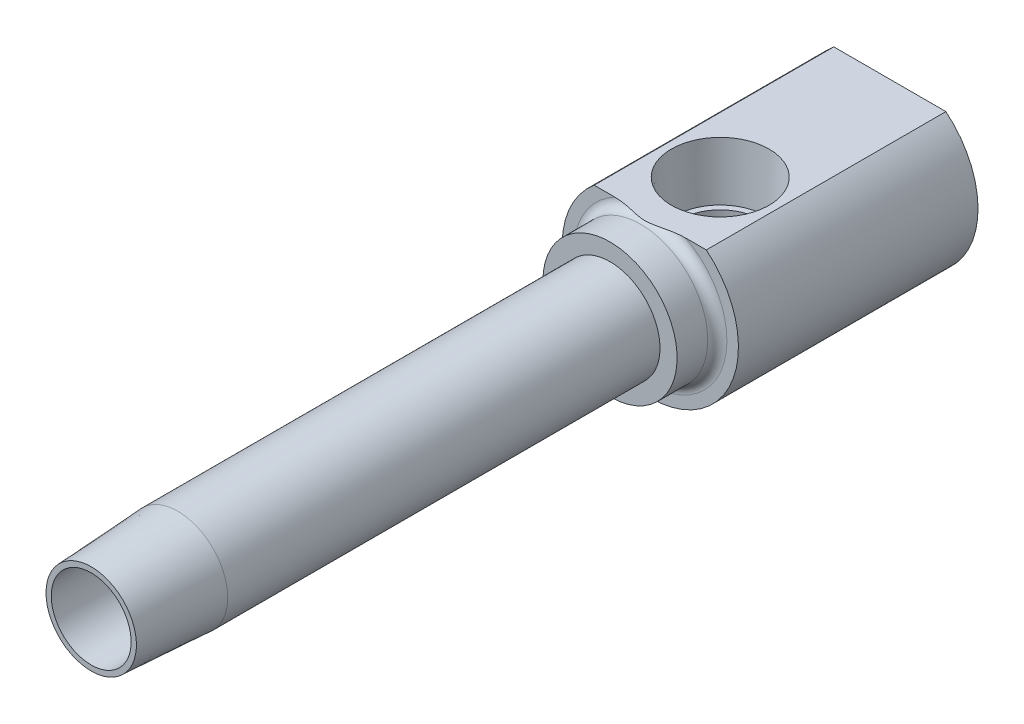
ISO-10303-21;
HEADER;
FILE_DESCRIPTION(('STEP AP214'),'2;1');
FILE_NAME('part.step','',(''),(''),'','','');
FILE_SCHEMA(('AUTOMOTIVE_DESIGN { 1 0 10303 214 1 1 1 1 }'));
ENDSEC;
DATA;
#1=APPLICATION_CONTEXT('core data for automotive mechanical design processes');
#2=APPLICATION_PROTOCOL_DEFINITION('international standard','automotive_design',2000,#1);
#3=PRODUCT_CONTEXT('',#1,'mechanical');
#4=PRODUCT('Part','Part','',(#3));
#5=PRODUCT_RELATED_PRODUCT_CATEGORY('part','',(#4));
#6=PRODUCT_DEFINITION_FORMATION('','',#4);
#7=PRODUCT_DEFINITION_CONTEXT('part definition',#1,'design');
#8=PRODUCT_DEFINITION('design','',#6,#7);
#9=PRODUCT_DEFINITION_SHAPE('','',#8);
#10=(LENGTH_UNIT() NAMED_UNIT(*) SI_UNIT(.MILLI.,.METRE.));
#11=(NAMED_UNIT(*) PLANE_ANGLE_UNIT() SI_UNIT($,.RADIAN.));
#12=(NAMED_UNIT(*) SI_UNIT($,.STERADIAN.) SOLID_ANGLE_UNIT());
#13=UNCERTAINTY_MEASURE_WITH_UNIT(LENGTH_MEASURE(1.E-05),#10,'distance_accuracy_value','');
#14=(GEOMETRIC_REPRESENTATION_CONTEXT(3) GLOBAL_UNCERTAINTY_ASSIGNED_CONTEXT((#13)) GLOBAL_UNIT_ASSIGNED_CONTEXT((#10,
#11,#12)) REPRESENTATION_CONTEXT('',''));
#15=CARTESIAN_POINT('',(0.,0.,0.));
#16=DIRECTION('',(0.,0.,1.));
#17=DIRECTION('',(1.,0.,0.));
#18=AXIS2_PLACEMENT_3D('',#15,#16,#17);
#19=CARTESIAN_POINT('',(0.,0.,-109.334766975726));
#20=DIRECTION('',(0.,0.,-1.));
#21=DIRECTION('',(-1.,0.,0.));
#22=AXIS2_PLACEMENT_3D('',#19,#20,#21);
#23=CYLINDRICAL_SURFACE('',#22,3.9751);
#24=CARTESIAN_POINT('',(0.,0.,-6.8834));
#25=DIRECTION('',(0.,0.,-1.));
#26=DIRECTION('',(-1.,0.,0.));
#27=AXIS2_PLACEMENT_3D('',#24,#25,#26);
#28=CIRCLE('',#27,3.9751);
#29=CARTESIAN_POINT('',(-3.9751,0.,-6.8834));
#30=VERTEX_POINT('',#29);
#31=EDGE_CURVE('E230',#30,#30,#28,.T.);
#32=ORIENTED_EDGE('',*,*,#31,.T.);
#33=EDGE_LOOP('',(#32));
#34=FACE_BOUND('',#33,.T.);
#35=CARTESIAN_POINT('',(0.,0.,-41.2496));
#36=DIRECTION('',(0.,0.,-1.));
#37=DIRECTION('',(-1.,0.,0.));
#38=AXIS2_PLACEMENT_3D('',#35,#36,#37);
#39=CIRCLE('',#38,3.9751);
#40=CARTESIAN_POINT('',(-3.9751,0.,-41.2496));
#41=VERTEX_POINT('',#40);
#42=EDGE_CURVE('E190',#41,#41,#39,.T.);
#43=ORIENTED_EDGE('',*,*,#42,.F.);
#44=EDGE_LOOP('',(#43));
#45=FACE_BOUND('',#44,.T.);
#46=ADVANCED_FACE('F15',(#34,#45),#23,.T.);
#47=CARTESIAN_POINT('',(-3.175,0.,-41.2496));
#48=DIRECTION('',(0.,0.,1.));
#49=DIRECTION('',(1.,0.,0.));
#50=AXIS2_PLACEMENT_3D('',#47,#48,#49);
#51=PLANE('',#50);
#52=CARTESIAN_POINT('',(0.,0.,-41.2496));
#53=DIRECTION('',(0.,0.,-1.));
#54=DIRECTION('',(-1.,0.,0.));
#55=AXIS2_PLACEMENT_3D('',#52,#53,#54);
#56=CIRCLE('',#55,3.175);
#57=CARTESIAN_POINT('',(-3.175,0.,-41.2496));
#58=VERTEX_POINT('',#57);
#59=EDGE_CURVE('E234',#58,#58,#56,.T.);
#60=ORIENTED_EDGE('',*,*,#59,.F.);
#61=EDGE_LOOP('',(#60));
#62=FACE_BOUND('',#61,.T.);
#63=CARTESIAN_POINT('',(0.,-0.206790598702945,-41.2496));
#64=DIRECTION('',(0.,0.,1.));
#65=DIRECTION('',(0.,1.,0.));
#66=AXIS2_PLACEMENT_3D('',#63,#64,#65);
#67=ELLIPSE('',#66,2.91070678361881,2.77750646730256);
#68=CARTESIAN_POINT('',(0.,2.70391618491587,-41.2496));
#69=VERTEX_POINT('',#68);
#70=EDGE_CURVE('E192',#69,#69,#67,.F.);
#71=ORIENTED_EDGE('',*,*,#70,.T.);
#72=EDGE_LOOP('',(#71));
#73=FACE_BOUND('',#72,.T.);
#74=ADVANCED_FACE('F211',(#62,#73),#51,.T.);
#75=CARTESIAN_POINT('',(-3.9751,0.,-41.2496));
#76=DIRECTION('',(0.,0.,1.));
#77=DIRECTION('',(1.,0.,0.));
#78=AXIS2_PLACEMENT_3D('',#75,#76,#77);
#79=PLANE('',#78);
#80=ORIENTED_EDGE('',*,*,#42,.T.);
#81=EDGE_LOOP('',(#80));
#82=FACE_BOUND('',#81,.T.);
#83=CARTESIAN_POINT('',(0.,0.,-41.2496));
#84=DIRECTION('',(0.,0.,-1.));
#85=DIRECTION('',(-1.,0.,0.));
#86=AXIS2_PLACEMENT_3D('',#83,#84,#85);
#87=CIRCLE('',#86,5.334);
#88=CARTESIAN_POINT('',(-5.334,0.,-41.2496));
#89=VERTEX_POINT('',#88);
#90=EDGE_CURVE('E252',#89,#89,#87,.T.);
#91=ORIENTED_EDGE('',*,*,#90,.F.);
#92=EDGE_LOOP('',(#91));
#93=FACE_BOUND('',#92,.T.);
#94=ADVANCED_FACE('F214',(#82,#93),#79,.T.);
#95=CARTESIAN_POINT('',(-3.175,0.,0.));
#96=DIRECTION('',(0.,0.,1.));
#97=DIRECTION('',(1.,0.,0.));
#98=AXIS2_PLACEMENT_3D('',#95,#96,#97);
#99=PLANE('',#98);
#100=CARTESIAN_POINT('',(0.,0.,0.));
#101=DIRECTION('',(0.,0.,-1.));
#102=DIRECTION('',(-1.,0.,0.));
#103=AXIS2_PLACEMENT_3D('',#100,#101,#102);
#104=CIRCLE('',#103,3.5941);
#105=CARTESIAN_POINT('',(-3.5941,0.,0.));
#106=VERTEX_POINT('',#105);
#107=EDGE_CURVE('E508',#106,#106,#104,.T.);
#108=ORIENTED_EDGE('',*,*,#107,.F.);
#109=EDGE_LOOP('',(#108));
#110=FACE_BOUND('',#109,.T.);
#111=CARTESIAN_POINT('',(0.,0.,0.));
#112=DIRECTION('',(0.,0.,-1.));
#113=DIRECTION('',(-1.,0.,0.));
#114=AXIS2_PLACEMENT_3D('',#111,#112,#113);
#115=CIRCLE('',#114,3.175);
#116=CARTESIAN_POINT('',(-3.175,0.,0.));
#117=VERTEX_POINT('',#116);
#118=EDGE_CURVE('E19',#117,#117,#115,.T.);
#119=ORIENTED_EDGE('',*,*,#118,.T.);
#120=EDGE_LOOP('',(#119));
#121=FACE_BOUND('',#120,.T.);
#122=ADVANCED_FACE('F17',(#110,#121),#99,.T.);
#123=CARTESIAN_POINT('',(0.,0.,-109.334766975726));
#124=DIRECTION('',(0.,0.,-1.));
#125=DIRECTION('',(-1.,0.,0.));
#126=AXIS2_PLACEMENT_3D('',#123,#124,#125);
#127=CYLINDRICAL_SURFACE('',#126,3.175);
#128=ORIENTED_EDGE('',*,*,#59,.T.);
#129=EDGE_LOOP('',(#128));
#130=FACE_BOUND('',#129,.T.);
#131=ORIENTED_EDGE('',*,*,#118,.F.);
#132=EDGE_LOOP('',(#131));
#133=FACE_BOUND('',#132,.T.);
#134=ADVANCED_FACE('F209',(#130,#133),#127,.F.);
#135=CARTESIAN_POINT('',(-7.0104,0.,-63.5));
#136=DIRECTION('',(0.,0.,-1.));
#137=DIRECTION('',(-1.,0.,0.));
#138=AXIS2_PLACEMENT_3D('',#135,#136,#137);
#139=PLANE('',#138);
#140=DIRECTION('',(1.,0.,0.));
#141=VECTOR('',#140,1.);
#142=CARTESIAN_POINT('',(-1.83308710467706,3.175,-63.5));
#143=LINE('',#142,#141);
#144=CARTESIAN_POINT('',(-1.83308710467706,3.175,-63.5));
#145=VERTEX_POINT('',#144);
#146=CARTESIAN_POINT('',(1.83308710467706,3.175,-63.5));
#147=VERTEX_POINT('',#146);
#148=EDGE_CURVE('E37',#145,#147,#143,.T.);
#149=ORIENTED_EDGE('',*,*,#148,.F.);
#150=DIRECTION('',(0.5,0.866025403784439,0.));
#151=VECTOR('',#150,1.);
#152=CARTESIAN_POINT('',(-3.66617420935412,0.,-63.5));
#153=LINE('',#152,#151);
#154=CARTESIAN_POINT('',(-3.66617420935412,0.,-63.5));
#155=VERTEX_POINT('',#154);
#156=EDGE_CURVE('E278',#155,#145,#153,.T.);
#157=ORIENTED_EDGE('',*,*,#156,.F.);
#158=DIRECTION('',(-0.5,0.866025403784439,0.));
#159=VECTOR('',#158,1.);
#160=CARTESIAN_POINT('',(-1.83308710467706,-3.175,-63.5));
#161=LINE('',#160,#159);
#162=CARTESIAN_POINT('',(-1.83308710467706,-3.175,-63.5));
#163=VERTEX_POINT('',#162);
#164=EDGE_CURVE('E282',#163,#155,#161,.T.);
#165=ORIENTED_EDGE('',*,*,#164,.F.);
#166=DIRECTION('',(-1.,0.,0.));
#167=VECTOR('',#166,1.);
#168=CARTESIAN_POINT('',(1.83308710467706,-3.175,-63.5));
#169=LINE('',#168,#167);
#170=CARTESIAN_POINT('',(1.83308710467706,-3.175,-63.5));
#171=VERTEX_POINT('',#170);
#172=EDGE_CURVE('E285',#171,#163,#169,.T.);
#173=ORIENTED_EDGE('',*,*,#172,.F.);
#174=DIRECTION('',(-0.5,-0.866025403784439,0.));
#175=VECTOR('',#174,1.);
#176=CARTESIAN_POINT('',(3.66617420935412,0.,-63.5));
#177=LINE('',#176,#175);
#178=CARTESIAN_POINT('',(3.66617420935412,0.,-63.5));
#179=VERTEX_POINT('',#178);
#180=EDGE_CURVE('E288',#179,#171,#177,.T.);
#181=ORIENTED_EDGE('',*,*,#180,.F.);
#182=DIRECTION('',(0.5,-0.866025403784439,0.));
#183=VECTOR('',#182,1.);
#184=CARTESIAN_POINT('',(1.83308710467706,3.175,-63.5));
#185=LINE('',#184,#183);
#186=EDGE_CURVE('E291',#147,#179,#185,.T.);
#187=ORIENTED_EDGE('',*,*,#186,.F.);
#188=EDGE_LOOP('',(#149,#157,#165,#173,#181,#187));
#189=FACE_BOUND('',#188,.T.);
#190=DIRECTION('',(-1.,0.,0.));
#191=VECTOR('',#190,1.);
#192=CARTESIAN_POINT('',(-4.4577,5.41060244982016,-63.5));
#193=LINE('',#192,#191);
#194=CARTESIAN_POINT('',(4.4577,5.41060244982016,-63.5));
#195=VERTEX_POINT('',#194);
#196=CARTESIAN_POINT('',(-4.4577,5.41060244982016,-63.5));
#197=VERTEX_POINT('',#196);
#198=EDGE_CURVE('E261',#195,#197,#193,.T.);
#199=ORIENTED_EDGE('',*,*,#198,.F.);
#200=CARTESIAN_POINT('',(0.,0.,-63.5));
#201=DIRECTION('',(0.,0.,-1.));
#202=DIRECTION('',(-1.,0.,0.));
#203=AXIS2_PLACEMENT_3D('',#200,#201,#202);
#204=CIRCLE('',#203,7.0104);
#205=EDGE_CURVE('E238',#195,#197,#204,.T.);
#206=ORIENTED_EDGE('',*,*,#205,.T.);
#207=EDGE_LOOP('',(#199,#206));
#208=FACE_BOUND('',#207,.T.);
#209=ADVANCED_FACE('F205',(#189,#208),#139,.T.);
#210=CARTESIAN_POINT('',(0.,0.,-109.334766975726));
#211=DIRECTION('',(0.,0.,-1.));
#212=DIRECTION('',(-1.,0.,0.));
#213=AXIS2_PLACEMENT_3D('',#210,#211,#212);
#214=CYLINDRICAL_SURFACE('',#213,7.0104);
#215=DIRECTION('',(0.,0.,-1.));
#216=VECTOR('',#215,1.);
#217=CARTESIAN_POINT('',(-4.4577,5.41060244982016,-34.1376));
#218=LINE('',#217,#216);
#219=CARTESIAN_POINT('',(-4.4577,5.41060244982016,-44.45));
#220=VERTEX_POINT('',#219);
#221=EDGE_CURVE('E258',#220,#197,#218,.T.);
#222=ORIENTED_EDGE('',*,*,#221,.T.);
#223=ORIENTED_EDGE('',*,*,#205,.F.);
#224=DIRECTION('',(0.,0.,-1.));
#225=VECTOR('',#224,1.);
#226=CARTESIAN_POINT('',(4.4577,5.41060244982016,-34.1376));
#227=LINE('',#226,#225);
#228=CARTESIAN_POINT('',(4.4577,5.41060244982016,-44.45));
#229=VERTEX_POINT('',#228);
#230=EDGE_CURVE('E259',#229,#195,#227,.T.);
#231=ORIENTED_EDGE('',*,*,#230,.F.);
#232=CARTESIAN_POINT('',(0.,0.,-44.45));
#233=DIRECTION('',(0.,0.,-1.));
#234=DIRECTION('',(-1.,0.,0.));
#235=AXIS2_PLACEMENT_3D('',#232,#233,#234);
#236=CIRCLE('',#235,7.0104);
#237=EDGE_CURVE('E241',#229,#220,#236,.T.);
#238=ORIENTED_EDGE('',*,*,#237,.T.);
#239=EDGE_LOOP('',(#222,#223,#231,#238));
#240=FACE_BOUND('',#239,.T.);
#241=ADVANCED_FACE('F201',(#240),#214,.T.);
#242=CARTESIAN_POINT('',(-6.096,0.,-44.45));
#243=DIRECTION('',(0.,0.,1.));
#244=DIRECTION('',(1.,0.,0.));
#245=AXIS2_PLACEMENT_3D('',#242,#243,#244);
#246=PLANE('',#245);
#247=DIRECTION('',(1.,0.,0.));
#248=VECTOR('',#247,1.);
#249=CARTESIAN_POINT('',(-6.096,5.41060244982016,-44.45));
#250=LINE('',#249,#248);
#251=CARTESIAN_POINT('',(-2.80830858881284,5.41060244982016,-44.45));
#252=VERTEX_POINT('',#251);
#253=EDGE_CURVE('E255',#220,#252,#250,.T.);
#254=ORIENTED_EDGE('',*,*,#253,.F.);
#255=ORIENTED_EDGE('',*,*,#237,.F.);
#256=CARTESIAN_POINT('',(2.80830858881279,5.41060244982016,-44.4500000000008));
#257=VERTEX_POINT('',#256);
#258=EDGE_CURVE('E256',#257,#229,#250,.T.);
#259=ORIENTED_EDGE('',*,*,#258,.F.);
#260=CARTESIAN_POINT('',(0.,0.,-44.45));
#261=DIRECTION('',(0.,0.,-1.));
#262=DIRECTION('',(-1.,0.,0.));
#263=AXIS2_PLACEMENT_3D('',#260,#261,#262);
#264=CIRCLE('',#263,6.096);
#265=EDGE_CURVE('E246',#257,#252,#264,.T.);
#266=ORIENTED_EDGE('',*,*,#265,.T.);
#267=EDGE_LOOP('',(#254,#255,#259,#266));
#268=FACE_BOUND('',#267,.T.);
#269=ADVANCED_FACE('F197',(#268),#246,.T.);
#270=CARTESIAN_POINT('',(0.,0.,-43.688));
#271=DIRECTION('',(0.,0.,-1.));
#272=DIRECTION('',(-1.,0.,0.));
#273=AXIS2_PLACEMENT_3D('',#270,#271,#272);
#274=TOROIDAL_SURFACE('',#273,6.096,0.762);
#275=CARTESIAN_POINT('',(0.,5.41060244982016,-44.0209777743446));
#276=CARTESIAN_POINT('',(0.052147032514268,5.41060244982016,-44.0209662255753));
#277=CARTESIAN_POINT('',(0.104287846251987,5.41060244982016,-44.0225421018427));
#278=CARTESIAN_POINT('',(0.208401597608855,5.41060244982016,-44.0286316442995));
#279=CARTESIAN_POINT('',(0.260374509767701,5.41060244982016,-44.0331457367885));
#280=CARTESIAN_POINT('',(0.416241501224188,5.41060244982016,-44.0504483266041));
#281=CARTESIAN_POINT('',(0.519704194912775,5.41060244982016,-44.0669914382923));
#282=CARTESIAN_POINT('',(0.726918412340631,5.41060244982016,-44.1056198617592));
#283=CARTESIAN_POINT('',(0.830655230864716,5.41060244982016,-44.1277764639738));
#284=CARTESIAN_POINT('',(1.03759009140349,5.41060244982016,-44.1738404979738));
#285=CARTESIAN_POINT('',(1.14078865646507,5.41060244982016,-44.1977456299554));
#286=CARTESIAN_POINT('',(1.34834228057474,5.41060244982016,-44.2452053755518));
#287=CARTESIAN_POINT('',(1.4526986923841,5.41060244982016,-44.2687541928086));
#288=CARTESIAN_POINT('',(1.66197970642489,5.41060244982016,-44.313460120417));
#289=CARTESIAN_POINT('',(1.76690452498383,5.41060244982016,-44.3346162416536));
#290=CARTESIAN_POINT('',(1.97693672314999,5.41060244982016,-44.3728529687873));
#291=CARTESIAN_POINT('',(2.08204009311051,5.41060244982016,-44.3899548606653));
#292=CARTESIAN_POINT('',(2.2929864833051,5.41060244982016,-44.4186452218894));
#293=CARTESIAN_POINT('',(2.39882937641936,5.41060244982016,-44.4302346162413));
#294=CARTESIAN_POINT('',(2.63825679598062,5.41060244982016,-44.4481707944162));
#295=CARTESIAN_POINT('',(2.77203238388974,5.41060244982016,-44.4524268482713));
#296=CARTESIAN_POINT('',(2.97236053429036,5.41060244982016,-44.4467542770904));
#297=CARTESIAN_POINT('',(3.03908464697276,5.41060244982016,-44.4428533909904));
#298=CARTESIAN_POINT('',(3.17206397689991,5.41060244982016,-44.430250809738));
#299=CARTESIAN_POINT('',(3.2383194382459,5.41060244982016,-44.4215518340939));
#300=CARTESIAN_POINT('',(3.37725624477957,5.41060244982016,-44.39711512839));
#301=CARTESIAN_POINT('',(3.44982215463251,5.41060244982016,-44.38069575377));
#302=CARTESIAN_POINT('',(3.59245961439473,5.41060244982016,-44.3390714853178));
#303=CARTESIAN_POINT('',(3.6625332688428,5.41060244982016,-44.3138742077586));
#304=CARTESIAN_POINT('',(3.77900159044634,5.41060244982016,-44.2610231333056));
#305=CARTESIAN_POINT('',(3.82657256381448,5.41060244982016,-44.2359897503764));
#306=CARTESIAN_POINT('',(3.91754959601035,5.41060244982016,-44.179184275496));
#307=CARTESIAN_POINT('',(3.96096325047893,5.41060244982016,-44.1474248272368));
#308=CARTESIAN_POINT('',(4.02798010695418,5.41060244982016,-44.0878907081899));
#309=CARTESIAN_POINT('',(4.05342428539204,5.41060244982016,-44.0621989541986));
#310=CARTESIAN_POINT('',(4.10009948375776,5.41060244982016,-44.0072158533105));
#311=CARTESIAN_POINT('',(4.12133630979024,5.41060244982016,-43.9779295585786));
#312=CARTESIAN_POINT('',(4.15466127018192,5.41060244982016,-43.9218876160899));
#313=CARTESIAN_POINT('',(4.16772173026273,5.41060244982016,-43.8957142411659));
#314=CARTESIAN_POINT('',(4.18933719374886,5.41060244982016,-43.8415567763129));
#315=CARTESIAN_POINT('',(4.19789541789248,5.41060244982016,-43.8135739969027));
#316=CARTESIAN_POINT('',(4.20987180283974,5.41060244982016,-43.7563342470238));
#317=CARTESIAN_POINT('',(4.21325884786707,5.41060244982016,-43.727070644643));
#318=CARTESIAN_POINT('',(4.21447858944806,5.41060244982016,-43.6684289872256));
#319=CARTESIAN_POINT('',(4.21231242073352,5.41060244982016,-43.6390509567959));
#320=CARTESIAN_POINT('',(4.20309810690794,5.41060244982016,-43.583964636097));
#321=CARTESIAN_POINT('',(4.19653350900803,5.41060244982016,-43.5581729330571));
#322=CARTESIAN_POINT('',(4.17948851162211,5.41060244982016,-43.5079301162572));
#323=CARTESIAN_POINT('',(4.16900680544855,5.41060244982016,-43.4834794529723));
#324=CARTESIAN_POINT('',(4.14035818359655,5.41060244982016,-43.4278520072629));
#325=CARTESIAN_POINT('',(4.12078333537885,5.41060244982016,-43.3974012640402));
#326=CARTESIAN_POINT('',(4.07697861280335,5.41060244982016,-43.3400600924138));
#327=CARTESIAN_POINT('',(4.05273917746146,5.41060244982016,-43.3131771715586));
#328=CARTESIAN_POINT('',(3.98868725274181,5.41060244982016,-43.2511561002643));
#329=CARTESIAN_POINT('',(3.94690497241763,5.41060244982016,-43.218064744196));
#330=CARTESIAN_POINT('',(3.85879527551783,5.41060244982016,-43.1586936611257));
#331=CARTESIAN_POINT('',(3.81245915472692,5.41060244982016,-43.1324273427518));
#332=CARTESIAN_POINT('',(3.7245267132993,5.41060244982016,-43.0894458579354));
#333=CARTESIAN_POINT('',(3.68333828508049,5.41060244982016,-43.0718773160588));
#334=CARTESIAN_POINT('',(3.59958587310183,5.41060244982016,-43.0403604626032));
#335=CARTESIAN_POINT('',(3.55702092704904,5.41060244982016,-43.0264147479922));
#336=CARTESIAN_POINT('',(3.42786902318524,5.41060244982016,-42.9892902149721));
#337=CARTESIAN_POINT('',(3.33991210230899,5.41060244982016,-42.9708635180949));
#338=CARTESIAN_POINT('',(3.16528158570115,5.41060244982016,-42.9442403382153));
#339=CARTESIAN_POINT('',(3.07864723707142,5.41060244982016,-42.9357567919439));
#340=CARTESIAN_POINT('',(2.90489485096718,5.41060244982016,-42.9261313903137));
#341=CARTESIAN_POINT('',(2.8177763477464,5.41060244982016,-42.9249986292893));
#342=CARTESIAN_POINT('',(2.64327811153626,5.41060244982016,-42.9286504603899));
#343=CARTESIAN_POINT('',(2.55589913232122,5.41060244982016,-42.9334634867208));
#344=CARTESIAN_POINT('',(2.38166962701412,5.41060244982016,-42.9478649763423));
#345=CARTESIAN_POINT('',(2.29481855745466,5.41060244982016,-42.9574471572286));
#346=CARTESIAN_POINT('',(2.01384766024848,5.41060244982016,-42.9946709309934));
#347=CARTESIAN_POINT('',(1.82076533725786,5.41060244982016,-43.0299456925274));
#348=CARTESIAN_POINT('',(1.53229430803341,5.41060244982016,-43.0898846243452));
#349=CARTESIAN_POINT('',(1.43609183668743,5.41060244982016,-43.1110969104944));
#350=CARTESIAN_POINT('',(1.24390982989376,5.41060244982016,-43.1545341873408));
#351=CARTESIAN_POINT('',(1.1479302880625,5.41060244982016,-43.1767591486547));
#352=CARTESIAN_POINT('',(0.957697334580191,5.41060244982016,-43.2200933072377));
#353=CARTESIAN_POINT('',(0.863446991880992,5.41060244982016,-43.2412158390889));
#354=CARTESIAN_POINT('',(0.674290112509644,5.41060244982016,-43.2805444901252));
#355=CARTESIAN_POINT('',(0.579383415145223,5.41060244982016,-43.2987498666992));
#356=CARTESIAN_POINT('',(0.389272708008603,5.41060244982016,-43.3287534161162));
#357=CARTESIAN_POINT('',(0.294077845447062,5.41060244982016,-43.3406039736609));
#358=CARTESIAN_POINT('',(0.15079180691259,5.41060244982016,-43.3511395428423));
#359=CARTESIAN_POINT('',(0.102969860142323,5.41060244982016,-43.353445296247));
#360=CARTESIAN_POINT('',(0.00727423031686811,5.41060244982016,-43.3554444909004));
#361=CARTESIAN_POINT('',(-0.0405994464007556,5.41060244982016,-43.3551382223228));
#362=CARTESIAN_POINT('',(-0.136934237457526,5.41060244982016,-43.3519171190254));
#363=CARTESIAN_POINT('',(-0.185394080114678,5.41060244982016,-43.3489654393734));
#364=CARTESIAN_POINT('',(-0.282118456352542,5.41060244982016,-43.3406895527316));
#365=CARTESIAN_POINT('',(-0.330382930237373,5.41060244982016,-43.3353646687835));
#366=CARTESIAN_POINT('',(-0.475151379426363,5.41060244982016,-43.3164493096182));
#367=CARTESIAN_POINT('',(-0.571263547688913,5.41060244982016,-43.2999364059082));
#368=CARTESIAN_POINT('',(-0.76404790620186,5.41060244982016,-43.2625658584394));
#369=CARTESIAN_POINT('',(-0.860707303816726,5.41060244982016,-43.2416474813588));
#370=CARTESIAN_POINT('',(-1.05357295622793,5.41060244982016,-43.1984599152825));
#371=CARTESIAN_POINT('',(-1.1497796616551,5.41060244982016,-43.1761927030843));
#372=CARTESIAN_POINT('',(-1.36433899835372,5.41060244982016,-43.1271440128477));
#373=CARTESIAN_POINT('',(-1.48272280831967,5.41060244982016,-43.1004952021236));
#374=CARTESIAN_POINT('',(-1.72029970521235,5.41060244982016,-43.0505730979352));
#375=CARTESIAN_POINT('',(-1.83949323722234,5.41060244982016,-43.0273018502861));
#376=CARTESIAN_POINT('',(-2.07789765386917,5.41060244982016,-42.9865910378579));
#377=CARTESIAN_POINT('',(-2.19710038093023,5.41060244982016,-42.9691052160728));
#378=CARTESIAN_POINT('',(-2.43636519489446,5.41060244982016,-42.9420638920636));
#379=CARTESIAN_POINT('',(-2.55642644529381,5.41060244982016,-42.9325015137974));
#380=CARTESIAN_POINT('',(-2.76780194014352,5.41060244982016,-42.9251640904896));
#381=CARTESIAN_POINT('',(-2.85902659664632,5.41060244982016,-42.9250928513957));
#382=CARTESIAN_POINT('',(-3.04144991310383,5.41060244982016,-42.9327518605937));
#383=CARTESIAN_POINT('',(-3.13264774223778,5.41060244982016,-42.9405045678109));
#384=CARTESIAN_POINT('',(-3.31458996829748,5.41060244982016,-42.9660861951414));
#385=CARTESIAN_POINT('',(-3.40532344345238,5.41060244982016,-42.9840025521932));
#386=CARTESIAN_POINT('',(-3.53857286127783,5.41060244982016,-43.0206989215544));
#387=CARTESIAN_POINT('',(-3.58245316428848,5.41060244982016,-43.0345411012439));
#388=CARTESIAN_POINT('',(-3.66883050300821,5.41060244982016,-43.0659851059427));
#389=CARTESIAN_POINT('',(-3.71132868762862,5.41060244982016,-43.0835837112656));
#390=CARTESIAN_POINT('',(-3.79234387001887,5.41060244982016,-43.1221781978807));
#391=CARTESIAN_POINT('',(-3.83095410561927,5.41060244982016,-43.1429757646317));
#392=CARTESIAN_POINT('',(-3.9054933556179,5.41060244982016,-43.1890810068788));
#393=CARTESIAN_POINT('',(-3.94141935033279,5.41060244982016,-43.2143936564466));
#394=CARTESIAN_POINT('',(-4.00964525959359,5.41060244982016,-43.2703927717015));
#395=CARTESIAN_POINT('',(-4.04189445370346,5.41060244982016,-43.301142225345));
#396=CARTESIAN_POINT('',(-4.10014383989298,5.41060244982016,-43.3680849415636));
#397=CARTESIAN_POINT('',(-4.12616464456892,5.41060244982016,-43.4042595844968));
#398=CARTESIAN_POINT('',(-4.16162371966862,5.41060244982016,-43.4677603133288));
#399=CARTESIAN_POINT('',(-4.17366550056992,5.41060244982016,-43.4936338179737));
#400=CARTESIAN_POINT('',(-4.19334521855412,5.41060244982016,-43.5470140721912));
#401=CARTESIAN_POINT('',(-4.20098675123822,5.41060244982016,-43.5745194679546));
#402=CARTESIAN_POINT('',(-4.21130602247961,5.41060244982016,-43.6306094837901));
#403=CARTESIAN_POINT('',(-4.21395773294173,5.41060244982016,-43.6591989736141));
#404=CARTESIAN_POINT('',(-4.21398264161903,5.41060244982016,-43.7163806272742));
#405=CARTESIAN_POINT('',(-4.21135613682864,5.41060244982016,-43.7449727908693));
#406=CARTESIAN_POINT('',(-4.20143815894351,5.41060244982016,-43.7991597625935));
#407=CARTESIAN_POINT('',(-4.1945008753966,5.41060244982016,-43.8248210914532));
#408=CARTESIAN_POINT('',(-4.17676949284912,5.41060244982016,-43.8747618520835));
#409=CARTESIAN_POINT('',(-4.1659739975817,5.41060244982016,-43.899040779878));
#410=CARTESIAN_POINT('',(-4.13643456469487,5.41060244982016,-43.9546640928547));
#411=CARTESIAN_POINT('',(-4.11622825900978,5.41060244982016,-43.9852311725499));
#412=CARTESIAN_POINT('',(-4.07115731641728,5.41060244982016,-44.0427092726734));
#413=CARTESIAN_POINT('',(-4.04628281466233,5.41060244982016,-44.0696123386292));
#414=CARTESIAN_POINT('',(-3.98047143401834,5.41060244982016,-44.1317969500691));
#415=CARTESIAN_POINT('',(-3.93753463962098,5.41060244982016,-44.1649489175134));
#416=CARTESIAN_POINT('',(-3.84713170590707,5.41060244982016,-44.2242768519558));
#417=CARTESIAN_POINT('',(-3.79965701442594,5.41060244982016,-44.2504392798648));
#418=CARTESIAN_POINT('',(-3.70945527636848,5.41060244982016,-44.2932191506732));
#419=CARTESIAN_POINT('',(-3.66712202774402,5.41060244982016,-44.3106859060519));
#420=CARTESIAN_POINT('',(-3.58109351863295,5.41060244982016,-44.3419030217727));
#421=CARTESIAN_POINT('',(-3.53739729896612,5.41060244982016,-44.355650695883));
#422=CARTESIAN_POINT('',(-3.4048693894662,5.41060244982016,-44.3920695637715));
#423=CARTESIAN_POINT('',(-3.3146965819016,5.41060244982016,-44.4098735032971));
#424=CARTESIAN_POINT('',(-3.13512177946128,5.41060244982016,-44.4351720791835));
#425=CARTESIAN_POINT('',(-3.04574747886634,5.41060244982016,-44.4428878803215));
#426=CARTESIAN_POINT('',(-2.8665916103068,5.41060244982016,-44.4507574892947));
#427=CARTESIAN_POINT('',(-2.77680968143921,5.41060244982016,-44.4509021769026));
#428=CARTESIAN_POINT('',(-2.59707026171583,5.41060244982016,-44.4451298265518));
#429=CARTESIAN_POINT('',(-2.5071138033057,5.41060244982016,-44.4391854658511));
#430=CARTESIAN_POINT('',(-2.32777785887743,5.41060244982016,-44.4224498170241));
#431=CARTESIAN_POINT('',(-2.23839782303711,5.41060244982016,-44.4116641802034));
#432=CARTESIAN_POINT('',(-1.96748151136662,5.41060244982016,-44.3730986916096));
#433=CARTESIAN_POINT('',(-1.78682109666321,5.41060244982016,-44.3393132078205));
#434=CARTESIAN_POINT('',(-1.51682052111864,5.41060244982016,-44.28271359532));
#435=CARTESIAN_POINT('',(-1.42679945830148,5.41060244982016,-44.2628126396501));
#436=CARTESIAN_POINT('',(-1.24695389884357,5.41060244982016,-44.2221437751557));
#437=CARTESIAN_POINT('',(-1.1571293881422,5.41060244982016,-44.2013759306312));
#438=CARTESIAN_POINT('',(-0.979057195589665,5.41060244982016,-44.1607394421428));
#439=CARTESIAN_POINT('',(-0.890811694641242,5.41060244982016,-44.140861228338));
#440=CARTESIAN_POINT('',(-0.713780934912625,5.41060244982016,-44.1034018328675));
#441=CARTESIAN_POINT('',(-0.624995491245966,5.41060244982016,-44.0858214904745));
#442=CARTESIAN_POINT('',(-0.447203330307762,5.41060244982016,-44.055660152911));
#443=CARTESIAN_POINT('',(-0.358203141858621,5.41060244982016,-44.0430430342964));
#444=CARTESIAN_POINT('',(-0.1794617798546,5.41060244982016,-44.0257167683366));
#445=CARTESIAN_POINT('',(-0.0897216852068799,5.41060244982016,-44.0209976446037));
#446=CARTESIAN_POINT('',(0.,5.41060244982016,-44.0209777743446));
#447=B_SPLINE_CURVE_WITH_KNOTS('',3,(#275,#276,#277,#278,#279,#280,#281,#282,#283,#284,#285,
#286,#287,#288,#289,#290,#291,#292,#293,#294,#295,#296,#297,#298,#299,#300,#301,#302,#303,#304,
#305,#306,#307,#308,#309,#310,#311,#312,#313,#314,#315,#316,#317,#318,#319,#320,#321,#322,#323,
#324,#325,#326,#327,#328,#329,#330,#331,#332,#333,#334,#335,#336,#337,#338,#339,#340,#341,#342,
#343,#344,#345,#346,#347,#348,#349,#350,#351,#352,#353,#354,#355,#356,#357,#358,#359,#360,#361,
#362,#363,#364,#365,#366,#367,#368,#369,#370,#371,#372,#373,#374,#375,#376,#377,#378,#379,#380,
#381,#382,#383,#384,#385,#386,#387,#388,#389,#390,#391,#392,#393,#394,#395,#396,#397,#398,#399,
#400,#401,#402,#403,#404,#405,#406,#407,#408,#409,#410,#411,#412,#413,#414,#415,#416,#417,#418,
#419,#420,#421,#422,#423,#424,#425,#426,#427,#428,#429,#430,#431,#432,#433,#434,#435,#436,#437,
#438,#439,#440,#441,#442,#443,#444,#445,#446),.UNSPECIFIED.,.T.,.F.,(4,2,2,2,2,2,2,2,2,2,2,2,2,
2,2,2,2,2,2,2,2,2,2,2,2,2,2,2,2,2,2,2,2,2,2,2,2,2,2,2,2,2,2,2,2,2,2,2,2,2,2,2,2,2,2,2,2,2,2,2,2,
2,2,2,2,2,2,2,2,2,2,2,2,2,2,2,2,2,2,2,2,2,2,2,2,4),(0.,0.156408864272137,0.312840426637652,
0.626836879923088,0.945040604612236,1.2628330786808,1.5837652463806,1.90482960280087,
2.22416896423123,2.54345472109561,2.9441659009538,3.14454518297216,3.34481100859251,
3.56760205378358,3.79020027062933,3.95104939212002,4.11159879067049,4.21974493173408,
4.32774077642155,4.41514397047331,4.50248455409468,4.59034863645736,4.67819476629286,
4.75769203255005,4.83721584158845,4.94521135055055,5.05343062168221,5.21243854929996,
5.37175654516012,5.5059015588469,5.64014246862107,5.90890810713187,6.16970670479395,
6.43082789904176,6.69320268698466,6.95523275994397,7.5434079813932,7.83896772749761,
8.13451890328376,8.42427298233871,8.71410070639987,9.0015010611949,9.14506775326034,
9.28861849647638,9.43420020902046,9.57982347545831,9.87216797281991,10.1688428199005,
10.4650929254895,10.8291174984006,11.193361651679,11.5546188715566,11.9155622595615,
12.1889721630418,12.4631691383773,12.7397615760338,12.8776619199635,13.0154445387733,
13.1467577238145,13.2782164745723,13.4113120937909,13.5439609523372,13.6292456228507,
13.7144605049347,13.8001186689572,13.885772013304,13.965178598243,14.0446139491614,
14.1539273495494,14.2634744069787,14.4253063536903,14.5874495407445,14.7246386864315,
14.8619266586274,15.1368206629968,15.4055810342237,15.6746651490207,15.9449620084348,
16.2149441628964,16.7658370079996,17.0424344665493,17.319011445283,17.5903768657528,
17.8618411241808,18.131291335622,18.4004009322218),.UNSPECIFIED.);
#448=EDGE_CURVE('E105',#252,#257,#447,.T.);
#449=ORIENTED_EDGE('',*,*,#448,.F.);
#450=ORIENTED_EDGE('',*,*,#265,.F.);
#451=EDGE_LOOP('',(#449,#450));
#452=FACE_BOUND('',#451,.T.);
#453=CARTESIAN_POINT('',(0.,0.,-43.688));
#454=DIRECTION('',(0.,0.,-1.));
#455=DIRECTION('',(-1.,0.,0.));
#456=AXIS2_PLACEMENT_3D('',#453,#454,#455);
#457=CIRCLE('',#456,5.334);
#458=CARTESIAN_POINT('',(-5.334,0.,-43.688));
#459=VERTEX_POINT('',#458);
#460=EDGE_CURVE('E249',#459,#459,#457,.T.);
#461=ORIENTED_EDGE('',*,*,#460,.T.);
#462=EDGE_LOOP('',(#461));
#463=FACE_BOUND('',#462,.T.);
#464=ADVANCED_FACE('F193',(#452,#463),#274,.F.);
#465=CARTESIAN_POINT('',(0.,0.,-109.334766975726));
#466=DIRECTION('',(0.,0.,-1.));
#467=DIRECTION('',(-1.,0.,0.));
#468=AXIS2_PLACEMENT_3D('',#465,#466,#467);
#469=CYLINDRICAL_SURFACE('',#468,5.334);
#470=ORIENTED_EDGE('',*,*,#90,.T.);
#471=EDGE_LOOP('',(#470));
#472=FACE_BOUND('',#471,.T.);
#473=ORIENTED_EDGE('',*,*,#460,.F.);
#474=EDGE_LOOP('',(#473));
#475=FACE_BOUND('',#474,.T.);
#476=ADVANCED_FACE('F183',(#472,#475),#469,.T.);
#477=CARTESIAN_POINT('',(-4.4577,5.41060244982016,-34.1376));
#478=DIRECTION('',(0.,-1.,0.));
#479=DIRECTION('',(0.,0.,-1.));
#480=AXIS2_PLACEMENT_3D('',#477,#478,#479);
#481=PLANE('',#480);
#482=CARTESIAN_POINT('',(0.,5.41060244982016,-50.0126));
#483=DIRECTION('',(0.,-1.,0.));
#484=DIRECTION('',(0.,0.,-1.));
#485=AXIS2_PLACEMENT_3D('',#482,#483,#484);
#486=CIRCLE('',#485,3.8800785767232);
#487=CARTESIAN_POINT('',(0.,5.41060244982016,-53.8926785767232));
#488=VERTEX_POINT('',#487);
#489=EDGE_CURVE('E510',#488,#488,#486,.T.);
#490=ORIENTED_EDGE('',*,*,#489,.T.);
#491=EDGE_LOOP('',(#490));
#492=FACE_BOUND('',#491,.T.);
#493=ORIENTED_EDGE('',*,*,#253,.T.);
#494=ORIENTED_EDGE('',*,*,#448,.T.);
#495=ORIENTED_EDGE('',*,*,#258,.T.);
#496=ORIENTED_EDGE('',*,*,#230,.T.);
#497=ORIENTED_EDGE('',*,*,#198,.T.);
#498=ORIENTED_EDGE('',*,*,#221,.F.);
#499=EDGE_LOOP('',(#493,#494,#495,#496,#497,#498));
#500=FACE_BOUND('',#499,.T.);
#501=ADVANCED_FACE('F179',(#492,#500),#481,.F.);
#502=CARTESIAN_POINT('',(-1.83308710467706,3.175,-58.674));
#503=DIRECTION('',(0.,1.,0.));
#504=DIRECTION('',(-1.,0.,0.));
#505=AXIS2_PLACEMENT_3D('',#502,#503,#504);
#506=PLANE('',#505);
#507=ORIENTED_EDGE('',*,*,#148,.T.);
#508=DIRECTION('',(0.,0.,-1.));
#509=VECTOR('',#508,1.);
#510=CARTESIAN_POINT('',(1.83308710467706,3.175,-58.674));
#511=LINE('',#510,#509);
#512=CARTESIAN_POINT('',(1.83308710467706,3.175,-58.674));
#513=VERTEX_POINT('',#512);
#514=EDGE_CURVE('E266',#513,#147,#511,.T.);
#515=ORIENTED_EDGE('',*,*,#514,.F.);
#516=DIRECTION('',(1.,0.,0.));
#517=VECTOR('',#516,1.);
#518=CARTESIAN_POINT('',(-1.83308710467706,3.175,-58.674));
#519=LINE('',#518,#517);
#520=CARTESIAN_POINT('',(-1.83308710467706,3.175,-58.674));
#521=VERTEX_POINT('',#520);
#522=EDGE_CURVE('E281',#521,#513,#519,.T.);
#523=ORIENTED_EDGE('',*,*,#522,.F.);
#524=DIRECTION('',(0.,0.,-1.));
#525=VECTOR('',#524,1.);
#526=CARTESIAN_POINT('',(-1.83308710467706,3.175,-58.674));
#527=LINE('',#526,#525);
#528=EDGE_CURVE('E265',#521,#145,#527,.T.);
#529=ORIENTED_EDGE('',*,*,#528,.T.);
#530=EDGE_LOOP('',(#507,#515,#523,#529));
#531=FACE_BOUND('',#530,.T.);
#532=ADVANCED_FACE('F161',(#531),#506,.F.);
#533=CARTESIAN_POINT('',(-3.66617420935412,0.,-58.674));
#534=DIRECTION('',(-0.866025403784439,0.5,0.));
#535=DIRECTION('',(-0.5,-0.866025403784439,0.));
#536=AXIS2_PLACEMENT_3D('',#533,#534,#535);
#537=PLANE('',#536);
#538=ORIENTED_EDGE('',*,*,#156,.T.);
#539=ORIENTED_EDGE('',*,*,#528,.F.);
#540=DIRECTION('',(0.5,0.866025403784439,0.));
#541=VECTOR('',#540,1.);
#542=CARTESIAN_POINT('',(-3.66617420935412,0.,-58.674));
#543=LINE('',#542,#541);
#544=CARTESIAN_POINT('',(-3.66617420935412,0.,-58.674));
#545=VERTEX_POINT('',#544);
#546=EDGE_CURVE('E269',#545,#521,#543,.T.);
#547=ORIENTED_EDGE('',*,*,#546,.F.);
#548=DIRECTION('',(0.,0.,-1.));
#549=VECTOR('',#548,1.);
#550=CARTESIAN_POINT('',(-3.66617420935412,0.,-58.674));
#551=LINE('',#550,#549);
#552=EDGE_CURVE('E275',#545,#155,#551,.T.);
#553=ORIENTED_EDGE('',*,*,#552,.T.);
#554=EDGE_LOOP('',(#538,#539,#547,#553));
#555=FACE_BOUND('',#554,.T.);
#556=ADVANCED_FACE('F157',(#555),#537,.F.);
#557=CARTESIAN_POINT('',(-1.83308710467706,-3.175,-58.674));
#558=DIRECTION('',(-0.866025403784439,-0.5,0.));
#559=DIRECTION('',(0.5,-0.866025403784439,0.));
#560=AXIS2_PLACEMENT_3D('',#557,#558,#559);
#561=PLANE('',#560);
#562=ORIENTED_EDGE('',*,*,#164,.T.);
#563=ORIENTED_EDGE('',*,*,#552,.F.);
#564=DIRECTION('',(-0.5,0.866025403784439,0.));
#565=VECTOR('',#564,1.);
#566=CARTESIAN_POINT('',(-1.83308710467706,-3.175,-58.674));
#567=LINE('',#566,#565);
#568=CARTESIAN_POINT('',(-1.83308710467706,-3.175,-58.674));
#569=VERTEX_POINT('',#568);
#570=EDGE_CURVE('E297',#569,#545,#567,.T.);
#571=ORIENTED_EDGE('',*,*,#570,.F.);
#572=DIRECTION('',(0.,0.,-1.));
#573=VECTOR('',#572,1.);
#574=CARTESIAN_POINT('',(-1.83308710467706,-3.175,-58.674));
#575=LINE('',#574,#573);
#576=EDGE_CURVE('E273',#569,#163,#575,.T.);
#577=ORIENTED_EDGE('',*,*,#576,.T.);
#578=EDGE_LOOP('',(#562,#563,#571,#577));
#579=FACE_BOUND('',#578,.T.);
#580=ADVANCED_FACE('F160',(#579),#561,.F.);
#581=CARTESIAN_POINT('',(1.83308710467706,-3.175,-58.674));
#582=DIRECTION('',(0.,-1.,0.));
#583=DIRECTION('',(1.,0.,0.));
#584=AXIS2_PLACEMENT_3D('',#581,#582,#583);
#585=PLANE('',#584);
#586=ORIENTED_EDGE('',*,*,#172,.T.);
#587=ORIENTED_EDGE('',*,*,#576,.F.);
#588=DIRECTION('',(-1.,0.,0.));
#589=VECTOR('',#588,1.);
#590=CARTESIAN_POINT('',(1.83308710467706,-3.175,-58.674));
#591=LINE('',#590,#589);
#592=CARTESIAN_POINT('',(1.83308710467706,-3.175,-58.674));
#593=VERTEX_POINT('',#592);
#594=EDGE_CURVE('E300',#593,#569,#591,.T.);
#595=ORIENTED_EDGE('',*,*,#594,.F.);
#596=DIRECTION('',(0.,0.,-1.));
#597=VECTOR('',#596,1.);
#598=CARTESIAN_POINT('',(1.83308710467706,-3.175,-58.674));
#599=LINE('',#598,#597);
#600=EDGE_CURVE('E271',#593,#171,#599,.T.);
#601=ORIENTED_EDGE('',*,*,#600,.T.);
#602=EDGE_LOOP('',(#586,#587,#595,#601));
#603=FACE_BOUND('',#602,.T.);
#604=ADVANCED_FACE('F165',(#603),#585,.F.);
#605=CARTESIAN_POINT('',(3.66617420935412,0.,-58.674));
#606=DIRECTION('',(0.866025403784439,-0.5,0.));
#607=DIRECTION('',(0.5,0.866025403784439,0.));
#608=AXIS2_PLACEMENT_3D('',#605,#606,#607);
#609=PLANE('',#608);
#610=ORIENTED_EDGE('',*,*,#180,.T.);
#611=ORIENTED_EDGE('',*,*,#600,.F.);
#612=DIRECTION('',(-0.5,-0.866025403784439,0.));
#613=VECTOR('',#612,1.);
#614=CARTESIAN_POINT('',(3.66617420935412,0.,-58.674));
#615=LINE('',#614,#613);
#616=CARTESIAN_POINT('',(3.66617420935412,0.,-58.674));
#617=VERTEX_POINT('',#616);
#618=EDGE_CURVE('E303',#617,#593,#615,.T.);
#619=ORIENTED_EDGE('',*,*,#618,.F.);
#620=DIRECTION('',(0.,0.,-1.));
#621=VECTOR('',#620,1.);
#622=CARTESIAN_POINT('',(3.66617420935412,0.,-58.674));
#623=LINE('',#622,#621);
#624=EDGE_CURVE('E268',#617,#179,#623,.T.);
#625=ORIENTED_EDGE('',*,*,#624,.T.);
#626=EDGE_LOOP('',(#610,#611,#619,#625));
#627=FACE_BOUND('',#626,.T.);
#628=ADVANCED_FACE('F169',(#627),#609,.F.);
#629=CARTESIAN_POINT('',(1.83308710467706,3.175,-58.674));
#630=DIRECTION('',(0.866025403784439,0.5,0.));
#631=DIRECTION('',(-0.5,0.866025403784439,0.));
#632=AXIS2_PLACEMENT_3D('',#629,#630,#631);
#633=PLANE('',#632);
#634=ORIENTED_EDGE('',*,*,#186,.T.);
#635=ORIENTED_EDGE('',*,*,#624,.F.);
#636=DIRECTION('',(0.5,-0.866025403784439,0.));
#637=VECTOR('',#636,1.);
#638=CARTESIAN_POINT('',(1.83308710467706,3.175,-58.674));
#639=LINE('',#638,#637);
#640=EDGE_CURVE('E306',#513,#617,#639,.T.);
#641=ORIENTED_EDGE('',*,*,#640,.F.);
#642=ORIENTED_EDGE('',*,*,#514,.T.);
#643=EDGE_LOOP('',(#634,#635,#641,#642));
#644=FACE_BOUND('',#643,.T.);
#645=ADVANCED_FACE('F155',(#644),#633,.F.);
#646=CARTESIAN_POINT('',(0.,0.,-58.674));
#647=DIRECTION('',(0.,0.,-1.));
#648=DIRECTION('',(-1.,0.,0.));
#649=AXIS2_PLACEMENT_3D('',#646,#647,#648);
#650=PLANE('',#649);
#651=ORIENTED_EDGE('',*,*,#522,.T.);
#652=ORIENTED_EDGE('',*,*,#640,.T.);
#653=ORIENTED_EDGE('',*,*,#618,.T.);
#654=ORIENTED_EDGE('',*,*,#594,.T.);
#655=ORIENTED_EDGE('',*,*,#570,.T.);
#656=ORIENTED_EDGE('',*,*,#546,.T.);
#657=EDGE_LOOP('',(#651,#652,#653,#654,#655,#656));
#658=FACE_BOUND('',#657,.T.);
#659=ADVANCED_FACE('F151',(#658),#650,.T.);
#660=CARTESIAN_POINT('',(0.,-2.98624109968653,-49.9790554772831));
#661=DIRECTION('',(0.,0.298636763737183,0.954366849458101));
#662=DIRECTION('',(0.,-0.954366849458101,0.298636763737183));
#663=AXIS2_PLACEMENT_3D('',#660,#661,#662);
#664=CONICAL_SURFACE('',#663,2.29646041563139,0.826862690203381);
#665=CARTESIAN_POINT('',(-4.07250877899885,-2.19612830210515,-48.5020110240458));
#666=CARTESIAN_POINT('',(-3.92894564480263,-2.29613709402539,-48.6132886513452));
#667=CARTESIAN_POINT('',(-3.78492754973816,-2.39583064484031,-48.7242777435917));
#668=CARTESIAN_POINT('',(-3.49542612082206,-2.5941852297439,-48.9453997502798));
#669=CARTESIAN_POINT('',(-3.34994228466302,-2.6928458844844,-49.0555323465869));
#670=CARTESIAN_POINT('',(-3.05718484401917,-2.88857438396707,-49.2744858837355));
#671=CARTESIAN_POINT('',(-2.90991293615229,-2.98564356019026,-49.3833078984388));
#672=CARTESIAN_POINT('',(-2.61260725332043,-3.17745365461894,-49.599191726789));
#673=CARTESIAN_POINT('',(-2.46257392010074,-3.2721949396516,-49.7062538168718));
#674=CARTESIAN_POINT('',(-2.30585388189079,-3.36777676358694,-49.8152150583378));
#675=CARTESIAN_POINT('',(-2.30125812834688,-3.37057671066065,-49.8184077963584));
#676=CARTESIAN_POINT('',(-2.18325993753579,-3.4423898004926,-49.9003174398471));
#677=CARTESIAN_POINT('',(-2.06866761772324,-3.51030800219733,-49.9783122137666));
#678=CARTESIAN_POINT('',(-1.89428090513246,-3.60949921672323,-50.0938600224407));
#679=CARTESIAN_POINT('',(-1.83573157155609,-3.64211739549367,-50.1321377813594));
#680=CARTESIAN_POINT('',(-1.71764576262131,-3.70614874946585,-50.208162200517));
#681=CARTESIAN_POINT('',(-1.65810935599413,-3.73756200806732,-50.2459088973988));
#682=CARTESIAN_POINT('',(-1.50902814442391,-3.81348555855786,-50.3387975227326));
#683=CARTESIAN_POINT('',(-1.41877996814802,-3.85705520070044,-50.393603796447));
#684=CARTESIAN_POINT('',(-1.28105412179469,-3.9178838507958,-50.4753076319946));
#685=CARTESIAN_POINT('',(-1.23473646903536,-3.9374118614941,-50.5024674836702));
#686=CARTESIAN_POINT('',(-1.14132702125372,-3.97432114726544,-50.5569030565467));
#687=CARTESIAN_POINT('',(-1.09423547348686,-3.99170309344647,-50.5841787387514));
#688=CARTESIAN_POINT('',(-0.997307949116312,-4.02406270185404,-50.6406998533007));
#689=CARTESIAN_POINT('',(-0.947443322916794,-4.03889834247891,-50.6699788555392));
#690=CARTESIAN_POINT('',(-0.847763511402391,-4.06317338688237,-50.7308955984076));
#691=CARTESIAN_POINT('',(-0.79794836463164,-4.07262087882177,-50.7625297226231));
#692=CARTESIAN_POINT('',(-0.715255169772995,-4.08120879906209,-50.8209697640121));
#693=CARTESIAN_POINT('',(-0.681720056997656,-4.08256924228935,-50.8464423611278));
#694=CARTESIAN_POINT('',(-0.617985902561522,-4.07965525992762,-50.9008455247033));
#695=CARTESIAN_POINT('',(-0.58777215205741,-4.07540686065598,-50.9297595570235));
#696=CARTESIAN_POINT('',(-0.532214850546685,-4.06142412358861,-50.9907430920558));
#697=CARTESIAN_POINT('',(-0.506873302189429,-4.05168753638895,-51.0228138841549));
#698=CARTESIAN_POINT('',(-0.460853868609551,-4.02824244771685,-51.0889376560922));
#699=CARTESIAN_POINT('',(-0.440201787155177,-4.01451287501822,-51.123000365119));
#700=CARTESIAN_POINT('',(-0.402209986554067,-3.98452453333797,-51.1923272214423));
#701=CARTESIAN_POINT('',(-0.384909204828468,-3.96823960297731,-51.227600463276));
#702=CARTESIAN_POINT('',(-0.352569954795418,-3.93424634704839,-51.29851457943));
#703=CARTESIAN_POINT('',(-0.337533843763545,-3.916536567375,-51.3341557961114));
#704=CARTESIAN_POINT('',(-0.294316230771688,-3.86219954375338,-51.4412152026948));
#705=CARTESIAN_POINT('',(-0.268029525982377,-3.82436859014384,-51.5127605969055));
#706=CARTESIAN_POINT('',(-0.231716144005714,-3.77249148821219,-51.6092207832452));
#707=CARTESIAN_POINT('',(-0.222113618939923,-3.7588086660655,-51.6345098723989));
#708=CARTESIAN_POINT('',(-0.202474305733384,-3.73140875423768,-51.6848944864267));
#709=CARTESIAN_POINT('',(-0.192437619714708,-3.7176916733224,-51.7099900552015));
#710=CARTESIAN_POINT('',(-0.168352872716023,-3.68618578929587,-51.7674096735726));
#711=CARTESIAN_POINT('',(-0.154009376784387,-3.66841964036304,-51.7996255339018));
#712=CARTESIAN_POINT('',(-0.127399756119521,-3.6394056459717,-51.8520439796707));
#713=CARTESIAN_POINT('',(-0.116086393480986,-3.62799604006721,-51.8726056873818));
#714=CARTESIAN_POINT('',(-0.0967960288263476,-3.61145924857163,-51.9023498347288));
#715=CARTESIAN_POINT('',(-0.0899630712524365,-3.60603291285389,-51.9121000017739));
#716=CARTESIAN_POINT('',(-0.0750884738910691,-3.59558512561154,-51.9308567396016));
#717=CARTESIAN_POINT('',(-0.0670533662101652,-3.59056169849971,-51.9398669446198));
#718=CARTESIAN_POINT('',(-0.0548991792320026,-3.58446020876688,-51.9508035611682));
#719=CARTESIAN_POINT('',(-0.0516862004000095,-3.58296263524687,-51.9534871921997));
#720=CARTESIAN_POINT('',(-0.0449596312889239,-3.58012842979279,-51.9585650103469));
#721=CARTESIAN_POINT('',(-0.0414456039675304,-3.57879203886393,-51.9609587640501));
#722=CARTESIAN_POINT('',(-0.0340308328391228,-3.57633948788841,-51.9653510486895));
#723=CARTESIAN_POINT('',(-0.0301255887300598,-3.57522647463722,-51.9673439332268));
#724=CARTESIAN_POINT('',(-0.0219697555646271,-3.5733599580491,-51.9706856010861));
#725=CARTESIAN_POINT('',(-0.0177205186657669,-3.57260512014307,-51.9720367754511));
#726=CARTESIAN_POINT('',(-0.0102473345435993,-3.57172497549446,-51.9736121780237));
#727=CARTESIAN_POINT('',(-0.00708274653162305,-3.5714806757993,-51.9740494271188));
#728=CARTESIAN_POINT('',(-0.000714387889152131,-3.57126182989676,-51.9744411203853));
#729=CARTESIAN_POINT('',(0.00248936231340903,-3.57128714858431,-51.9743958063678));
#730=CARTESIAN_POINT('',(0.00883226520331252,-3.57160403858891,-51.9738286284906));
#731=CARTESIAN_POINT('',(0.011971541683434,-3.5718950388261,-51.9733077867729));
#732=CARTESIAN_POINT('',(0.0181194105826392,-3.57271024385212,-51.9718485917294));
#733=CARTESIAN_POINT('',(0.0211278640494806,-3.57323469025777,-51.970909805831));
#734=CARTESIAN_POINT('',(0.0286013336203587,-3.57481605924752,-51.9680787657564));
#735=CARTESIAN_POINT('',(0.0329459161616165,-3.57600690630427,-51.9659466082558));
#736=CARTESIAN_POINT('',(0.0412158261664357,-3.57869375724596,-51.9611348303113));
#737=CARTESIAN_POINT('',(0.0451398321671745,-3.58019068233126,-51.9584535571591));
#738=CARTESIAN_POINT('',(0.0583057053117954,-3.58579053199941,-51.9484204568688));
#739=CARTESIAN_POINT('',(0.0666020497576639,-3.59040705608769,-51.9401445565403));
#740=CARTESIAN_POINT('',(0.0818753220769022,-3.60012687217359,-51.9227053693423));
#741=CARTESIAN_POINT('',(0.088842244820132,-3.60523345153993,-51.9135360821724));
#742=CARTESIAN_POINT('',(0.102190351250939,-3.61591467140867,-51.8943390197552));
#743=CARTESIAN_POINT('',(0.108534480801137,-3.6214999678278,-51.8842913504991));
#744=CARTESIAN_POINT('',(0.120595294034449,-3.63282028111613,-51.8639044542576));
#745=CARTESIAN_POINT('',(0.126311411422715,-3.6385554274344,-51.8535649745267));
#746=CARTESIAN_POINT('',(0.142827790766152,-3.65591792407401,-51.8222256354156));
#747=CARTESIAN_POINT('',(0.152966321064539,-3.66767616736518,-51.800951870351));
#748=CARTESIAN_POINT('',(0.172289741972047,-3.69132323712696,-51.7580415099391));
#749=CARTESIAN_POINT('',(0.181473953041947,-3.70321215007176,-51.7364046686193));
#750=CARTESIAN_POINT('',(0.199269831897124,-3.72700226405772,-51.6929513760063));
#751=CARTESIAN_POINT('',(0.207882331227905,-3.738903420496,-51.6711352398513));
#752=CARTESIAN_POINT('',(0.229463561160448,-3.7691852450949,-51.615377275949));
#753=CARTESIAN_POINT('',(0.242231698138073,-3.78754086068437,-51.5813453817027));
#754=CARTESIAN_POINT('',(0.267799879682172,-3.82397965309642,-51.5131171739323));
#755=CARTESIAN_POINT('',(0.280599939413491,-3.84206264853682,-51.4789207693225));
#756=CARTESIAN_POINT('',(0.306854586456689,-3.87771318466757,-51.410503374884));
#757=CARTESIAN_POINT('',(0.320309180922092,-3.895280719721,-51.3762823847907));
#758=CARTESIAN_POINT('',(0.348599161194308,-3.92953632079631,-51.3079841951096));
#759=CARTESIAN_POINT('',(0.363433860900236,-3.94622481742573,-51.2739069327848));
#760=CARTESIAN_POINT('',(0.398407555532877,-3.98114177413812,-51.1998037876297));
#761=CARTESIAN_POINT('',(0.41901983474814,-3.99907733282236,-51.1598532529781));
#762=CARTESIAN_POINT('',(0.465471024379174,-4.03107989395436,-51.0816205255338));
#763=CARTESIAN_POINT('',(0.491277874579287,-4.04516943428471,-51.0433297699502));
#764=CARTESIAN_POINT('',(0.545373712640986,-4.06542869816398,-50.9753756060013));
#765=CARTESIAN_POINT('',(0.572759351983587,-4.07245088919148,-50.9452665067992));
#766=CARTESIAN_POINT('',(0.63162925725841,-4.08093258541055,-50.8884082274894));
#767=CARTESIAN_POINT('',(0.663120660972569,-4.0823822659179,-50.8616650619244));
#768=CARTESIAN_POINT('',(0.726968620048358,-4.08040036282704,-50.8122632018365));
#769=CARTESIAN_POINT('',(0.759244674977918,-4.07715530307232,-50.7894865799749));
#770=CARTESIAN_POINT('',(0.824583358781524,-4.06724495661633,-50.7458389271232));
#771=CARTESIAN_POINT('',(0.85764741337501,-4.06057293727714,-50.7249717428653));
#772=CARTESIAN_POINT('',(0.957502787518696,-4.03678737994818,-50.663626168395));
#773=CARTESIAN_POINT('',(1.02438068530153,-4.01595713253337,-50.6247969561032));
#774=CARTESIAN_POINT('',(1.14424359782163,-3.97341603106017,-50.5551927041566));
#775=CARTESIAN_POINT('',(1.19748827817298,-3.95259799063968,-50.5242691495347));
#776=CARTESIAN_POINT('',(1.30297042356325,-3.90857902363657,-50.4623826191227));
#777=CARTESIAN_POINT('',(1.35520787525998,-3.88537806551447,-50.4314196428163));
#778=CARTESIAN_POINT('',(1.45878040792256,-3.83727954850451,-50.3691444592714));
#779=CARTESIAN_POINT('',(1.51011420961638,-3.81237979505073,-50.3378318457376));
#780=CARTESIAN_POINT('',(1.61192451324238,-3.76133809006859,-50.2748239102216));
#781=CARTESIAN_POINT('',(1.66240096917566,-3.73519607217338,-50.2431285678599));
#782=CARTESIAN_POINT('',(1.81237855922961,-3.6555426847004,-50.1476678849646));
#783=CARTESIAN_POINT('',(1.91076959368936,-3.60064013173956,-50.0833218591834));
#784=CARTESIAN_POINT('',(2.10527415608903,-3.48854629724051,-49.9533541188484));
#785=CARTESIAN_POINT('',(2.20138879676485,-3.43135617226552,-49.8877330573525));
#786=CARTESIAN_POINT('',(2.30778939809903,-3.3666018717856,-49.8138740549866));
#787=CARTESIAN_POINT('',(2.31890687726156,-3.35981809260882,-49.8061417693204));
#788=CARTESIAN_POINT('',(2.34111888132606,-3.34622989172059,-49.7906638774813));
#789=CARTESIAN_POINT('',(2.35221340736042,-3.33942547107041,-49.7829182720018));
#790=CARTESIAN_POINT('',(2.36329704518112,-3.33261086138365,-49.775165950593));
#791=B_SPLINE_CURVE_WITH_KNOTS('',3,(#665,#666,#667,#668,#669,#670,#671,#672,#673,#674,#675,
#676,#677,#678,#679,#680,#681,#682,#683,#684,#685,#686,#687,#688,#689,#690,#691,#692,#693,#694,
#695,#696,#697,#698,#699,#700,#701,#702,#703,#704,#705,#706,#707,#708,#709,#710,#711,#712,#713,
#714,#715,#716,#717,#718,#719,#720,#721,#722,#723,#724,#725,#726,#727,#728,#729,#730,#731,#732,
#733,#734,#735,#736,#737,#738,#739,#740,#741,#742,#743,#744,#745,#746,#747,#748,#749,#750,#751,
#752,#753,#754,#755,#756,#757,#758,#759,#760,#761,#762,#763,#764,#765,#766,#767,#768,#769,#770,
#771,#772,#773,#774,#775,#776,#777,#778,#779,#780,#781,#782,#783,#784,#785,#786,#787,#788,#789,
#790),.UNSPECIFIED.,.F.,.F.,(4,2,2,2,2,2,2,2,2,2,2,2,2,2,2,2,2,2,2,2,2,2,2,2,2,2,2,2,2,2,2,2,2,
2,2,2,2,2,2,2,2,2,2,2,2,2,2,2,2,2,2,2,2,2,2,2,2,2,2,2,2,2,4),(0.,0.62206785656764,
1.24435668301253,1.8660951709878,2.48773504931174,2.50650707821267,2.96951057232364,
3.20104373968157,3.43256085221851,3.77506503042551,3.94643820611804,4.11775765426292,
4.29672726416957,4.47542751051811,4.60135076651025,4.72669175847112,4.85208416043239,
4.97815065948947,5.10560397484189,5.23318905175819,5.48838992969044,5.57933478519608,
5.67025836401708,5.78866806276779,5.86680365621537,5.90602976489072,5.94504999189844,
5.9583718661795,5.9717134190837,5.98523144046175,5.99869869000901,6.00826669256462,
6.01782990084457,6.0273726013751,6.03692520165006,6.05179036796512,6.06670095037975,
6.10419109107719,6.1419531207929,6.18130642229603,6.22069492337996,6.29965579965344,
6.37867252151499,6.45757167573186,6.57972991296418,6.70196612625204,6.82420367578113,
6.94638077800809,7.09133454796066,7.2354196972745,7.35860022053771,7.4819978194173,
7.60062536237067,7.71948685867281,7.95928812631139,8.15425409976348,8.34922265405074,
8.54444802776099,8.73968384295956,9.1288625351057,9.51784689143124,9.56328539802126,
9.60872160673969),.UNSPECIFIED.);
#792=CARTESIAN_POINT('',(-2.25549871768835,-3.39834193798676,-49.8501024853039));
#793=VERTEX_POINT('',#792);
#794=CARTESIAN_POINT('',(2.25549871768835,-3.39834193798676,-49.8501024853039));
#795=VERTEX_POINT('',#794);
#796=EDGE_CURVE('E110',#793,#795,#791,.T.);
#797=ORIENTED_EDGE('',*,*,#796,.F.);
#798=CARTESIAN_POINT('',(0.,-2.98624109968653,-49.9790554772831));
#799=DIRECTION('',(0.,-0.298636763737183,-0.954366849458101));
#800=DIRECTION('',(0.,0.954366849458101,-0.298636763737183));
#801=AXIS2_PLACEMENT_3D('',#798,#799,#800);
#802=CIRCLE('',#801,2.29646041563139);
#803=EDGE_CURVE('E117',#795,#793,#802,.T.);
#804=ORIENTED_EDGE('',*,*,#803,.F.);
#805=EDGE_LOOP('',(#797,#804));
#806=FACE_BOUND('',#805,.T.);
#807=CARTESIAN_POINT('',(0.,-3.61740950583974,-51.9961085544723));
#808=VERTEX_POINT('',#807);
#809=VERTEX_LOOP('',#808);
#810=FACE_BOUND('',#809,.T.);
#811=ADVANCED_FACE('F147',(#806,#810),#664,.F.);
#812=CARTESIAN_POINT('',(0.,0.10005952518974,-40.1160266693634));
#813=DIRECTION('',(0.,0.298636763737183,0.954366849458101));
#814=DIRECTION('',(0.,-0.954366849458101,0.298636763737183));
#815=AXIS2_PLACEMENT_3D('',#812,#813,#814);
#816=CONICAL_SURFACE('',#815,2.83954893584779,0.0525020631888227);
#817=CARTESIAN_POINT('',(2.25182818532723,-3.35036202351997,-50.6650629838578));
#818=CARTESIAN_POINT('',(2.25288853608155,-3.35830343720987,-50.6119814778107));
#819=CARTESIAN_POINT('',(2.25364641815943,-3.36545931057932,-50.5587778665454));
#820=CARTESIAN_POINT('',(2.25472371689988,-3.37800256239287,-50.4521443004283));
#821=CARTESIAN_POINT('',(2.25504301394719,-3.38338945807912,-50.3987142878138));
#822=CARTESIAN_POINT('',(2.2555924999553,-3.39659879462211,-50.2381022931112));
#823=CARTESIAN_POINT('',(2.25541356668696,-3.4014616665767,-50.1306507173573));
#824=CARTESIAN_POINT('',(2.25532962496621,-3.40208473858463,-49.9179221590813));
#825=CARTESIAN_POINT('',(2.25541905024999,-3.3980303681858,-49.8126459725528));
#826=CARTESIAN_POINT('',(2.25685593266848,-3.38099709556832,-49.6029202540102));
#827=CARTESIAN_POINT('',(2.25820234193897,-3.36802562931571,-49.4984701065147));
#828=CARTESIAN_POINT('',(2.26317892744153,-3.32968516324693,-49.2647982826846));
#829=CARTESIAN_POINT('',(2.26729922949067,-3.302015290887,-49.1359692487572));
#830=CARTESIAN_POINT('',(2.27808749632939,-3.23678674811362,-48.8807642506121));
#831=CARTESIAN_POINT('',(2.2847606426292,-3.19920801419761,-48.754393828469));
#832=CARTESIAN_POINT('',(2.30013752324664,-3.11589214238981,-48.5005706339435));
#833=CARTESIAN_POINT('',(2.30889330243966,-3.06995449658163,-48.3731881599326));
#834=CARTESIAN_POINT('',(2.32285889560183,-2.99733775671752,-48.1839644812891));
#835=CARTESIAN_POINT('',(2.32764087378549,-2.9725746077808,-48.121339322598));
#836=CARTESIAN_POINT('',(2.33740882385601,-2.92198880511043,-47.9965513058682));
#837=CARTESIAN_POINT('',(2.34239474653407,-2.89616640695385,-47.9343883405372));
#838=CARTESIAN_POINT('',(2.347444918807,-2.86990957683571,-47.8724144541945));
#839=B_SPLINE_CURVE_WITH_KNOTS('',3,(#817,#818,#819,#820,#821,#822,#823,#824,#825,#826,#827,
#828,#829,#830,#831,#832,#833,#834,#835,#836,#837,#838),.UNSPECIFIED.,.F.,.F.,(4,2,2,2,2,2,2,2,
2,2,4),(0.,0.161036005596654,0.322115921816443,0.64443441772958,0.960113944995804,
1.27553054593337,1.67045549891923,2.06618632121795,2.47309805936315,2.67563006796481,
2.87811349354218),.UNSPECIFIED.);
#840=CARTESIAN_POINT('',(2.34740644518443,-2.87010957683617,-47.8728864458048));
#841=VERTEX_POINT('',#840);
#842=EDGE_CURVE('E10',#795,#841,#839,.T.);
#843=ORIENTED_EDGE('',*,*,#842,.F.);
#844=ORIENTED_EDGE('',*,*,#803,.T.);
#845=CARTESIAN_POINT('',(-2.347444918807,-2.86990957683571,-47.8724144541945));
#846=CARTESIAN_POINT('',(-2.34073943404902,-2.90477830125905,-47.95475602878));
#847=CARTESIAN_POINT('',(-2.33414026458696,-2.93890888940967,-48.0374345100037));
#848=CARTESIAN_POINT('',(-2.32134513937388,-3.00519305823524,-48.2036788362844));
#849=CARTESIAN_POINT('',(-2.31514948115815,-3.03734517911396,-48.2872452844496));
#850=CARTESIAN_POINT('',(-2.303305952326,-3.09941465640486,-48.4561632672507));
#851=CARTESIAN_POINT('',(-2.29766388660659,-3.12930770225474,-48.5415242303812));
#852=CARTESIAN_POINT('',(-2.28723787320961,-3.18577335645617,-48.7133838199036));
#853=CARTESIAN_POINT('',(-2.28245377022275,-3.21234656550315,-48.7998822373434));
#854=CARTESIAN_POINT('',(-2.27414278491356,-3.26035165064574,-48.9707761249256));
#855=CARTESIAN_POINT('',(-2.27057462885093,-3.2819419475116,-49.0551245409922));
#856=CARTESIAN_POINT('',(-2.26460266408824,-3.32036680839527,-49.2249343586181));
#857=CARTESIAN_POINT('',(-2.26219858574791,-3.33720247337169,-49.3103954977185));
#858=CARTESIAN_POINT('',(-2.25856439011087,-3.36527251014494,-49.4819120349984));
#859=CARTESIAN_POINT('',(-2.25732953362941,-3.37652940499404,-49.5679635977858));
#860=CARTESIAN_POINT('',(-2.2557877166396,-3.39303892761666,-49.7406341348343));
#861=CARTESIAN_POINT('',(-2.25548050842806,-3.39829315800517,-49.8272529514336));
#862=CARTESIAN_POINT('',(-2.25532788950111,-3.40214505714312,-49.9762888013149));
#863=CARTESIAN_POINT('',(-2.25537704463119,-3.40219739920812,-50.038673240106));
#864=CARTESIAN_POINT('',(-2.25545627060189,-3.39932986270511,-50.1634199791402));
#865=CARTESIAN_POINT('',(-2.25548632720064,-3.39640777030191,-50.2257822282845));
#866=CARTESIAN_POINT('',(-2.25525889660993,-3.38776149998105,-50.3511738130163));
#867=CARTESIAN_POINT('',(-2.25499742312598,-3.38199909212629,-50.4142004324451));
#868=CARTESIAN_POINT('',(-2.25390645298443,-3.36797501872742,-50.5398996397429));
#869=CARTESIAN_POINT('',(-2.25307759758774,-3.35971618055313,-50.6025725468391));
#870=CARTESIAN_POINT('',(-2.25182818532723,-3.35036202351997,-50.6650629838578));
#871=B_SPLINE_CURVE_WITH_KNOTS('',3,(#845,#846,#847,#848,#849,#850,#851,#852,#853,#854,#855,
#856,#857,#858,#859,#860,#861,#862,#863,#864,#865,#866,#867,#868,#869,#870),.UNSPECIFIED.,.F.,
.F.,(4,2,2,2,2,2,2,2,2,2,2,2,4),(0.,0.269031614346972,0.538259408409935,0.810061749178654,
1.08181483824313,1.3431170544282,1.60435871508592,1.8645368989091,2.1246456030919,
2.31172983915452,2.49895342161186,2.68876878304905,2.87836996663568),.UNSPECIFIED.);
#872=CARTESIAN_POINT('',(-2.34740644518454,-2.87010957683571,-47.8728864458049));
#873=VERTEX_POINT('',#872);
#874=EDGE_CURVE('E24',#873,#793,#871,.T.);
#875=ORIENTED_EDGE('',*,*,#874,.F.);
#876=CARTESIAN_POINT('',(2.34736035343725,-2.87030957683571,-47.8728358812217));
#877=CARTESIAN_POINT('',(2.35935096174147,-2.81836861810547,-47.8860079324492));
#878=CARTESIAN_POINT('',(2.36955576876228,-2.76556742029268,-47.8974077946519));
#879=CARTESIAN_POINT('',(2.38643778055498,-2.65879148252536,-47.9164634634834));
#880=CARTESIAN_POINT('',(2.39311826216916,-2.6048178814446,-47.9241227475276));
#881=CARTESIAN_POINT('',(2.40295103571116,-2.49687797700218,-47.9354459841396));
#882=CARTESIAN_POINT('',(2.40614967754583,-2.44292138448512,-47.9391624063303));
#883=CARTESIAN_POINT('',(2.40933042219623,-2.33479615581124,-47.9428605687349));
#884=CARTESIAN_POINT('',(2.40931213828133,-2.28062749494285,-47.9428418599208));
#885=CARTESIAN_POINT('',(2.4047310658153,-2.11885558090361,-47.9375079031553));
#886=CARTESIAN_POINT('',(2.3956810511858,-2.01151554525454,-47.9269603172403));
#887=CARTESIAN_POINT('',(2.36727614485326,-1.79968302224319,-47.8947883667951));
#888=CARTESIAN_POINT('',(2.34788097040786,-1.69520335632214,-47.8731207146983));
#889=CARTESIAN_POINT('',(2.30360144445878,-1.50514867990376,-47.8255909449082));
#890=CARTESIAN_POINT('',(2.27991010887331,-1.41901828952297,-47.8007825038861));
#891=CARTESIAN_POINT('',(2.22649703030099,-1.24993829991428,-47.7470232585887));
#892=CARTESIAN_POINT('',(2.19677131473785,-1.16699083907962,-47.7180697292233));
#893=CARTESIAN_POINT('',(2.13148440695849,-1.00421560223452,-47.657295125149));
#894=CARTESIAN_POINT('',(2.09590648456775,-0.924397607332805,-47.6254659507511));
#895=CARTESIAN_POINT('',(2.01906267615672,-0.76830157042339,-47.5601273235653));
#896=CARTESIAN_POINT('',(1.97779813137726,-0.692022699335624,-47.5266182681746));
#897=CARTESIAN_POINT('',(1.88746165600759,-0.539809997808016,-47.4572984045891));
#898=CARTESIAN_POINT('',(1.83811906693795,-0.464051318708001,-47.4214523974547));
#899=CARTESIAN_POINT('',(1.73292194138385,-0.317139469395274,-47.3499460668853));
#900=CARTESIAN_POINT('',(1.67706538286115,-0.245987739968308,-47.3142858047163));
#901=CARTESIAN_POINT('',(1.49966241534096,-0.0409551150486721,-47.2092947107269));
#902=CARTESIAN_POINT('',(1.36777414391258,0.0853857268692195,-47.1415362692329));
#903=CARTESIAN_POINT('',(1.13793556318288,0.259841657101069,-47.0457866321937));
#904=CARTESIAN_POINT('',(1.04966554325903,0.318276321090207,-47.0131979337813));
#905=CARTESIAN_POINT('',(0.863843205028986,0.422505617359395,-46.9545068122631));
#906=CARTESIAN_POINT('',(0.76629575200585,0.468306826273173,-46.9284010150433));
#907=CARTESIAN_POINT('',(0.562109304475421,0.544532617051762,-46.8847055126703));
#908=CARTESIAN_POINT('',(0.45537998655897,0.574777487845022,-46.8672154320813));
#909=CARTESIAN_POINT('',(0.237083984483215,0.616054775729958,-46.8432986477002));
#910=CARTESIAN_POINT('',(0.125524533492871,0.627114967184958,-46.8368559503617));
#911=CARTESIAN_POINT('',(-0.0810957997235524,0.628689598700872,-46.8359386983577));
#912=CARTESIAN_POINT('',(-0.176140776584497,0.622017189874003,-46.8398254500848));
#913=CARTESIAN_POINT('',(-0.363442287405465,0.594503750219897,-46.8557920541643));
#914=CARTESIAN_POINT('',(-0.455697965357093,0.573658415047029,-46.8678743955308));
#915=CARTESIAN_POINT('',(-0.632689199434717,0.520120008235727,-46.8987169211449));
#916=CARTESIAN_POINT('',(-0.71755949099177,0.487756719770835,-46.9172909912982));
#917=CARTESIAN_POINT('',(-0.881231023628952,0.412984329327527,-46.9598496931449));
#918=CARTESIAN_POINT('',(-0.960030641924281,0.370572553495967,-46.9838357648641));
#919=CARTESIAN_POINT('',(-1.15620941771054,0.249640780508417,-47.051491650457));
#920=CARTESIAN_POINT('',(-1.26851788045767,0.164684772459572,-47.0983609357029));
#921=CARTESIAN_POINT('',(-1.47664976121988,-0.020785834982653,-47.1980678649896));
#922=CARTESIAN_POINT('',(-1.57241648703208,-0.121351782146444,-47.2509250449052));
#923=CARTESIAN_POINT('',(-1.72107321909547,-0.301360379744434,-47.3420824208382));
#924=CARTESIAN_POINT('',(-1.77807680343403,-0.377749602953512,-47.3798434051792));
#925=CARTESIAN_POINT('',(-1.88493793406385,-0.535489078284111,-47.4552614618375));
#926=CARTESIAN_POINT('',(-1.93479175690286,-0.616841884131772,-47.492918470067));
#927=CARTESIAN_POINT('',(-2.02752677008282,-0.783988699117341,-47.5669218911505));
#928=CARTESIAN_POINT('',(-2.07040808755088,-0.869782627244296,-47.6032683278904));
#929=CARTESIAN_POINT('',(-2.14920097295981,-1.04550024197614,-47.6732830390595));
#930=CARTESIAN_POINT('',(-2.18511626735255,-1.13542168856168,-47.7069527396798));
#931=CARTESIAN_POINT('',(-2.25970868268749,-1.34748044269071,-47.7796923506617));
#932=CARTESIAN_POINT('',(-2.29586336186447,-1.47105045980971,-47.8172583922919));
#933=CARTESIAN_POINT('',(-2.35444364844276,-1.72428944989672,-47.8801928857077));
#934=CARTESIAN_POINT('',(-2.37690771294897,-1.85394022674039,-47.9055954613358));
#935=CARTESIAN_POINT('',(-2.40214898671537,-2.08660166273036,-47.9344635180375));
#936=CARTESIAN_POINT('',(-2.40830070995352,-2.18875498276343,-47.9416689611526));
#937=CARTESIAN_POINT('',(-2.40946497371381,-2.3931911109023,-47.9430119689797));
#938=CARTESIAN_POINT('',(-2.404500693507,-2.49547320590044,-47.9371767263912));
#939=CARTESIAN_POINT('',(-2.38840239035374,-2.6426894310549,-47.9187353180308));
#940=CARTESIAN_POINT('',(-2.38201974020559,-2.6888939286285,-47.911455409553));
#941=CARTESIAN_POINT('',(-2.36664917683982,-2.78037193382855,-47.8941583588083));
#942=CARTESIAN_POINT('',(-2.35765999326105,-2.82564497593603,-47.8841398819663));
#943=CARTESIAN_POINT('',(-2.34736035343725,-2.87030957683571,-47.8728358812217));
#944=B_SPLINE_CURVE_WITH_KNOTS('',3,(#876,#877,#878,#879,#880,#881,#882,#883,#884,#885,#886,
#887,#888,#889,#890,#891,#892,#893,#894,#895,#896,#897,#898,#899,#900,#901,#902,#903,#904,#905,
#906,#907,#908,#909,#910,#911,#912,#913,#914,#915,#916,#917,#918,#919,#920,#921,#922,#923,#924,
#925,#926,#927,#928,#929,#930,#931,#932,#933,#934,#935,#936,#937,#938,#939,#940,#941,#942,#943),
.UNSPECIFIED.,.F.,.F.,(4,2,2,2,2,2,2,2,2,2,2,2,2,2,2,2,2,2,2,2,2,2,2,2,2,2,2,2,2,2,2,2,2,4),(0.,
0.164666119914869,0.329178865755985,0.491473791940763,0.653788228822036,0.977013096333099,
1.30150584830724,1.57926003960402,1.8571976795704,2.13594415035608,2.4146249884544,
2.70604440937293,2.99755453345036,3.57730910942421,3.90859191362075,4.23970193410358,
4.57455565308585,4.90892418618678,5.19352256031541,5.47820740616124,5.75532218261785,
6.03251078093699,6.47526975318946,6.91951728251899,7.22672664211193,7.53409541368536,
7.84145858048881,8.14865686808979,8.54993126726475,8.95007322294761,9.25667646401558,
9.56264096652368,9.70412496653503,9.84567803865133),.UNSPECIFIED.);
#945=EDGE_CURVE('E99',#841,#873,#944,.T.);
#946=ORIENTED_EDGE('',*,*,#945,.F.);
#947=EDGE_LOOP('',(#843,#844,#875,#946));
#948=FACE_BOUND('',#947,.T.);
#949=ORIENTED_EDGE('',*,*,#70,.F.);
#950=EDGE_LOOP('',(#949));
#951=FACE_BOUND('',#950,.T.);
#952=ADVANCED_FACE('F114',(#948,#951),#816,.F.);
#953=CARTESIAN_POINT('',(0.,-4.70392991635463,-50.0126));
#954=DIRECTION('',(0.,1.,0.));
#955=DIRECTION('',(0.,0.,1.));
#956=AXIS2_PLACEMENT_3D('',#953,#954,#955);
#957=CONICAL_SURFACE('',#956,0.,1.0471975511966);
#958=ORIENTED_EDGE('',*,*,#842,.T.);
#959=CARTESIAN_POINT('',(0.,-2.87010957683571,-50.0126));
#960=DIRECTION('',(0.,-1.,0.));
#961=DIRECTION('',(0.,0.,-1.));
#962=AXIS2_PLACEMENT_3D('',#959,#960,#961);
#963=CIRCLE('',#962,3.17627);
#964=EDGE_CURVE('E30',#873,#841,#963,.T.);
#965=ORIENTED_EDGE('',*,*,#964,.F.);
#966=ORIENTED_EDGE('',*,*,#874,.T.);
#967=ORIENTED_EDGE('',*,*,#796,.T.);
#968=EDGE_LOOP('',(#958,#965,#966,#967));
#969=FACE_BOUND('',#968,.T.);
#970=ADVANCED_FACE('F108',(#969),#957,.F.);
#971=CARTESIAN_POINT('',(0.,5.41060244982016,-50.0126));
#972=DIRECTION('',(0.,-1.,0.));
#973=DIRECTION('',(0.,0.,-1.));
#974=AXIS2_PLACEMENT_3D('',#971,#972,#973);
#975=CYLINDRICAL_SURFACE('',#974,3.17627);
#976=ORIENTED_EDGE('',*,*,#945,.T.);
#977=ORIENTED_EDGE('',*,*,#964,.T.);
#978=EDGE_LOOP('',(#976,#977));
#979=FACE_BOUND('',#978,.T.);
#980=CARTESIAN_POINT('',(0.,0.915609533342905,-50.0126));
#981=DIRECTION('',(0.,-1.,0.));
#982=DIRECTION('',(0.,0.,-1.));
#983=AXIS2_PLACEMENT_3D('',#980,#981,#982);
#984=CIRCLE('',#983,3.17627);
#985=CARTESIAN_POINT('',(0.,0.915609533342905,-53.18887));
#986=VERTEX_POINT('',#985);
#987=EDGE_CURVE('E111',#986,#986,#984,.T.);
#988=ORIENTED_EDGE('',*,*,#987,.F.);
#989=EDGE_LOOP('',(#988));
#990=FACE_BOUND('',#989,.T.);
#991=ADVANCED_FACE('F100',(#979,#990),#975,.F.);
#992=CARTESIAN_POINT('',(0.,0.915609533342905,-53.656689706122));
#993=DIRECTION('',(0.,-1.,0.));
#994=DIRECTION('',(0.,0.,-1.));
#995=AXIS2_PLACEMENT_3D('',#992,#993,#994);
#996=PLANE('',#995);
#997=CARTESIAN_POINT('',(0.,0.915609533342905,-50.0126));
#998=DIRECTION('',(0.,-1.,0.));
#999=DIRECTION('',(0.,0.,-1.));
#1000=AXIS2_PLACEMENT_3D('',#997,#998,#999);
#1001=CIRCLE('',#1000,3.64408970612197);
#1002=CARTESIAN_POINT('',(0.,0.915609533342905,-53.656689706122));
#1003=VERTEX_POINT('',#1002);
#1004=EDGE_CURVE('E513',#1003,#1003,#1001,.T.);
#1005=ORIENTED_EDGE('',*,*,#1004,.F.);
#1006=EDGE_LOOP('',(#1005));
#1007=FACE_BOUND('',#1006,.T.);
#1008=ORIENTED_EDGE('',*,*,#987,.T.);
#1009=EDGE_LOOP('',(#1008));
#1010=FACE_BOUND('',#1009,.T.);
#1011=ADVANCED_FACE('F409',(#1007,#1010),#996,.F.);
#1012=CARTESIAN_POINT('',(0.,0.915609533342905,-50.0126));
#1013=DIRECTION('',(0.,1.,0.));
#1014=DIRECTION('',(0.,0.,1.));
#1015=AXIS2_PLACEMENT_3D('',#1012,#1013,#1014);
#1016=CONICAL_SURFACE('',#1015,3.64408970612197,0.052452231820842);
#1017=ORIENTED_EDGE('',*,*,#489,.F.);
#1018=EDGE_LOOP('',(#1017));
#1019=FACE_BOUND('',#1018,.T.);
#1020=ORIENTED_EDGE('',*,*,#1004,.T.);
#1021=EDGE_LOOP('',(#1020));
#1022=FACE_BOUND('',#1021,.T.);
#1023=ADVANCED_FACE('F416',(#1019,#1022),#1016,.F.);
#1024=CARTESIAN_POINT('',(0.,0.,0.));
#1025=DIRECTION('',(0.,0.,-1.));
#1026=DIRECTION('',(-1.,0.,0.));
#1027=AXIS2_PLACEMENT_3D('',#1024,#1025,#1026);
#1028=CONICAL_SURFACE('',#1027,3.5941,0.0552941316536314);
#1029=ORIENTED_EDGE('',*,*,#31,.F.);
#1030=EDGE_LOOP('',(#1029));
#1031=FACE_BOUND('',#1030,.T.);
#1032=ORIENTED_EDGE('',*,*,#107,.T.);
#1033=EDGE_LOOP('',(#1032));
#1034=FACE_BOUND('',#1033,.T.);
#1035=ADVANCED_FACE('F424',(#1031,#1034),#1028,.T.);
#1036=CLOSED_SHELL('',(#46,#74,#94,#122,#134,#209,#241,#269,#464,#476,#501,#532,#556,#580,#604,
#628,#645,#659,#811,#952,#970,#991,#1011,#1023,#1035));
#1037=MANIFOLD_SOLID_BREP('B1',#1036);
#1038=ADVANCED_BREP_SHAPE_REPRESENTATION('',(#18,#1037),#14);
#1039=SHAPE_DEFINITION_REPRESENTATION(#9,#1038);
ENDSEC;
END-ISO-10303-21;
